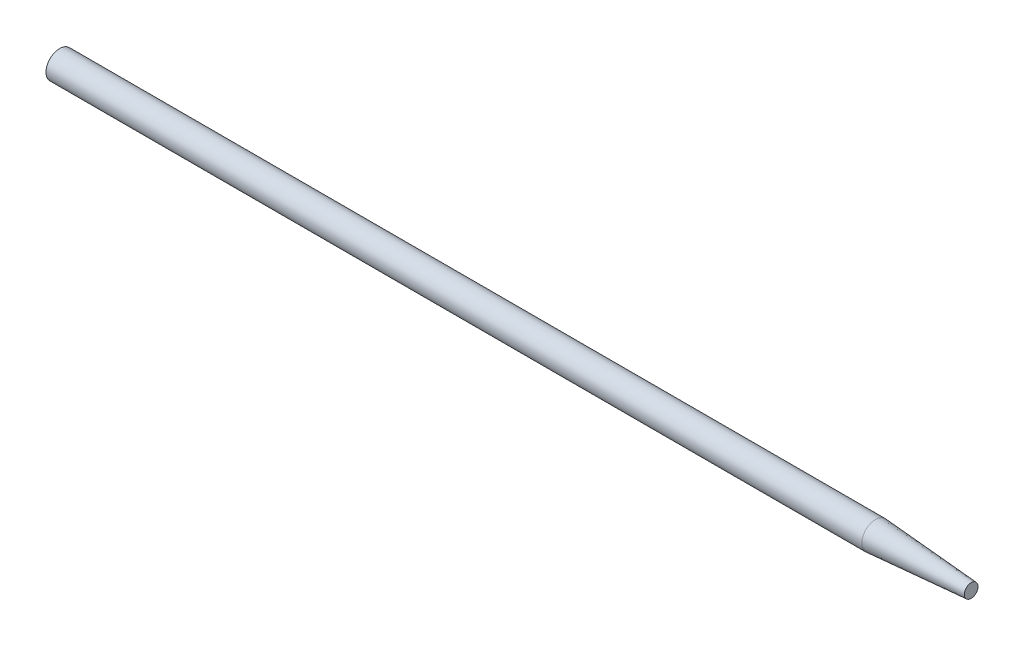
ISO-10303-21;
HEADER;
FILE_DESCRIPTION(('STEP AP214'),'2;1');
FILE_NAME('part.step','',(''),(''),'','','');
FILE_SCHEMA(('AUTOMOTIVE_DESIGN { 1 0 10303 214 1 1 1 1 }'));
ENDSEC;
DATA;
#1=APPLICATION_CONTEXT('core data for automotive mechanical design processes');
#2=APPLICATION_PROTOCOL_DEFINITION('international standard','automotive_design',2000,#1);
#3=PRODUCT_CONTEXT('',#1,'mechanical');
#4=PRODUCT('Part','Part','',(#3));
#5=PRODUCT_RELATED_PRODUCT_CATEGORY('part','',(#4));
#6=PRODUCT_DEFINITION_FORMATION('','',#4);
#7=PRODUCT_DEFINITION_CONTEXT('part definition',#1,'design');
#8=PRODUCT_DEFINITION('design','',#6,#7);
#9=PRODUCT_DEFINITION_SHAPE('','',#8);
#10=(LENGTH_UNIT() NAMED_UNIT(*) SI_UNIT(.MILLI.,.METRE.));
#11=(NAMED_UNIT(*) PLANE_ANGLE_UNIT() SI_UNIT($,.RADIAN.));
#12=(NAMED_UNIT(*) SI_UNIT($,.STERADIAN.) SOLID_ANGLE_UNIT());
#13=UNCERTAINTY_MEASURE_WITH_UNIT(LENGTH_MEASURE(1.E-05),#10,'distance_accuracy_value','');
#14=(GEOMETRIC_REPRESENTATION_CONTEXT(3) GLOBAL_UNCERTAINTY_ASSIGNED_CONTEXT((#13)) GLOBAL_UNIT_ASSIGNED_CONTEXT((#10,
#11,#12)) REPRESENTATION_CONTEXT('',''));
#15=CARTESIAN_POINT('',(0.,0.,0.));
#16=DIRECTION('',(0.,0.,1.));
#17=DIRECTION('',(1.,0.,0.));
#18=AXIS2_PLACEMENT_3D('',#15,#16,#17);
#19=CARTESIAN_POINT('',(0.,0.,0.));
#20=DIRECTION('',(1.,0.,0.));
#21=DIRECTION('',(0.,0.,-1.));
#22=AXIS2_PLACEMENT_3D('',#19,#20,#21);
#23=PLANE('',#22);
#24=CARTESIAN_POINT('',(0.,0.,0.));
#25=DIRECTION('',(-1.,0.,0.));
#26=DIRECTION('',(0.,0.,1.));
#27=AXIS2_PLACEMENT_3D('',#24,#25,#26);
#28=CIRCLE('',#27,7.5);
#29=CARTESIAN_POINT('',(0.,0.,7.5));
#30=VERTEX_POINT('',#29);
#31=EDGE_CURVE('E10',#30,#30,#28,.T.);
#32=ORIENTED_EDGE('',*,*,#31,.T.);
#33=EDGE_LOOP('',(#32));
#34=FACE_BOUND('',#33,.T.);
#35=ADVANCED_FACE('F37',(#34),#23,.F.);
#36=CARTESIAN_POINT('',(0.,0.,0.));
#37=DIRECTION('',(-1.,0.,0.));
#38=DIRECTION('',(0.,0.,1.));
#39=AXIS2_PLACEMENT_3D('',#36,#37,#38);
#40=CYLINDRICAL_SURFACE('',#39,7.5);
#41=ORIENTED_EDGE('',*,*,#31,.F.);
#42=EDGE_LOOP('',(#41));
#43=FACE_BOUND('',#42,.T.);
#44=CARTESIAN_POINT('',(447.506701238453,0.,0.));
#45=DIRECTION('',(-1.,0.,0.));
#46=DIRECTION('',(0.,0.,1.));
#47=AXIS2_PLACEMENT_3D('',#44,#45,#46);
#48=CIRCLE('',#47,7.5);
#49=CARTESIAN_POINT('',(447.506701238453,0.,7.5));
#50=VERTEX_POINT('',#49);
#51=EDGE_CURVE('E43',#50,#50,#48,.T.);
#52=ORIENTED_EDGE('',*,*,#51,.T.);
#53=EDGE_LOOP('',(#52));
#54=FACE_BOUND('',#53,.T.);
#55=ADVANCED_FACE('F62',(#43,#54),#40,.T.);
#56=CARTESIAN_POINT('',(500.,0.,0.));
#57=DIRECTION('',(-1.,0.,0.));
#58=DIRECTION('',(0.,0.,1.));
#59=AXIS2_PLACEMENT_3D('',#56,#57,#58);
#60=CONICAL_SURFACE('',#59,3.75,0.0713165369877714);
#61=ORIENTED_EDGE('',*,*,#51,.F.);
#62=EDGE_LOOP('',(#61));
#63=FACE_BOUND('',#62,.T.);
#64=CARTESIAN_POINT('',(500.,0.,0.));
#65=DIRECTION('',(-1.,0.,0.));
#66=DIRECTION('',(0.,0.,1.));
#67=AXIS2_PLACEMENT_3D('',#64,#65,#66);
#68=CIRCLE('',#67,3.75);
#69=CARTESIAN_POINT('',(500.,0.,3.75));
#70=VERTEX_POINT('',#69);
#71=EDGE_CURVE('E47',#70,#70,#68,.T.);
#72=ORIENTED_EDGE('',*,*,#71,.T.);
#73=EDGE_LOOP('',(#72));
#74=FACE_BOUND('',#73,.T.);
#75=ADVANCED_FACE('F54',(#63,#74),#60,.T.);
#76=CARTESIAN_POINT('',(500.,0.,0.));
#77=DIRECTION('',(-1.,0.,0.));
#78=DIRECTION('',(0.,0.,1.));
#79=AXIS2_PLACEMENT_3D('',#76,#77,#78);
#80=PLANE('',#79);
#81=ORIENTED_EDGE('',*,*,#71,.F.);
#82=EDGE_LOOP('',(#81));
#83=FACE_BOUND('',#82,.T.);
#84=ADVANCED_FACE('F56',(#83),#80,.F.);
#85=CLOSED_SHELL('',(#35,#55,#75,#84));
#86=MANIFOLD_SOLID_BREP('B2',#85);
#87=ADVANCED_BREP_SHAPE_REPRESENTATION('',(#18,#86),#14);
#88=SHAPE_DEFINITION_REPRESENTATION(#9,#87);
ENDSEC;
END-ISO-10303-21;
